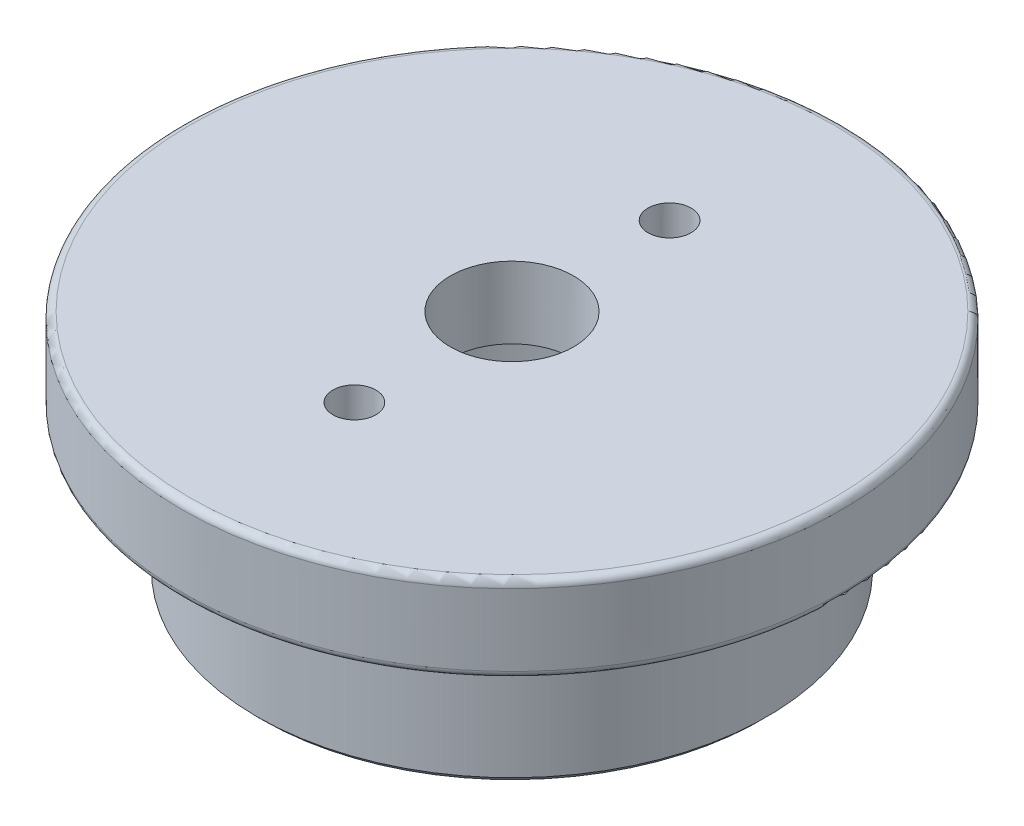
from build123d import *

# Parameters (mm, degrees)
M4_CLEARANCE_HOLE1_D       = 4.3
FILLET2_R                  = 0.25
SKETCH6_R                  = 7.1
CUT_EXTRUDE2_DEPTH         = 5.5
F_1_5_1_5_DIAMETER_HOLE1_D = 1.5
CHAMFER1_SIZE              = 0.2


with BuildPart() as part:
    # Sketch1 → Revolve1 (revolve)
    with BuildSketch(Plane.XY, mode=Mode.PRIVATE) as revolve1_sk:
        Polygon((0, 0), (8.9, 0), (8.9, 5), (11.5, 5), (11.5, 8), (0, 8), align=None)
    revolve(revolve1_sk.sketch.rotate(Axis((0, 0, 0), (0, 1, 0)), 90), axis=Axis((0, 0, 0), (0, 1, 0)))

    # M4 Clearance Hole1 (through all)
    with Locations(Plane(origin=(0, 8, 0), x_dir=(-1, 0, 0), z_dir=(0, 1, 0))):
        with Locations((0, 0)):
            Hole(M4_CLEARANCE_HOLE1_D / 2)

    # Fillet2
    fillet2_edges = [part.edges().sort_by_distance(p)[0] for p in [
        (0, 8, 11.5),
        (0, 5, 11.5),
    ]]
    fillet(fillet2_edges, radius=FILLET2_R)

    # Sketch6 → Cut-Extrude2 (cut)
    with BuildSketch(Plane.XZ):
        with Locations(Location((0, 0, 0), (0, 0, 270))):
            Circle(SKETCH6_R)
    extrude(amount=-CUT_EXTRUDE2_DEPTH, mode=Mode.SUBTRACT)

    # 1.5 _1.5_ Diameter Hole1 (through all)
    with Locations(Plane(origin=(0, 8, 0), x_dir=(-1, 0, 0), z_dir=(0, 1, 0))):
        with Locations((0, 5.5), (0, -5.5)):
            Hole(F_1_5_1_5_DIAMETER_HOLE1_D / 2)

    # Chamfer1
    chamfer1_edges = [part.edges().sort_by_distance(p)[0] for p in [
        (0, 0, 7.1),
        (0, 0, 8.9),
    ]]
    chamfer(chamfer1_edges, length=CHAMFER1_SIZE)


solid = part.part
